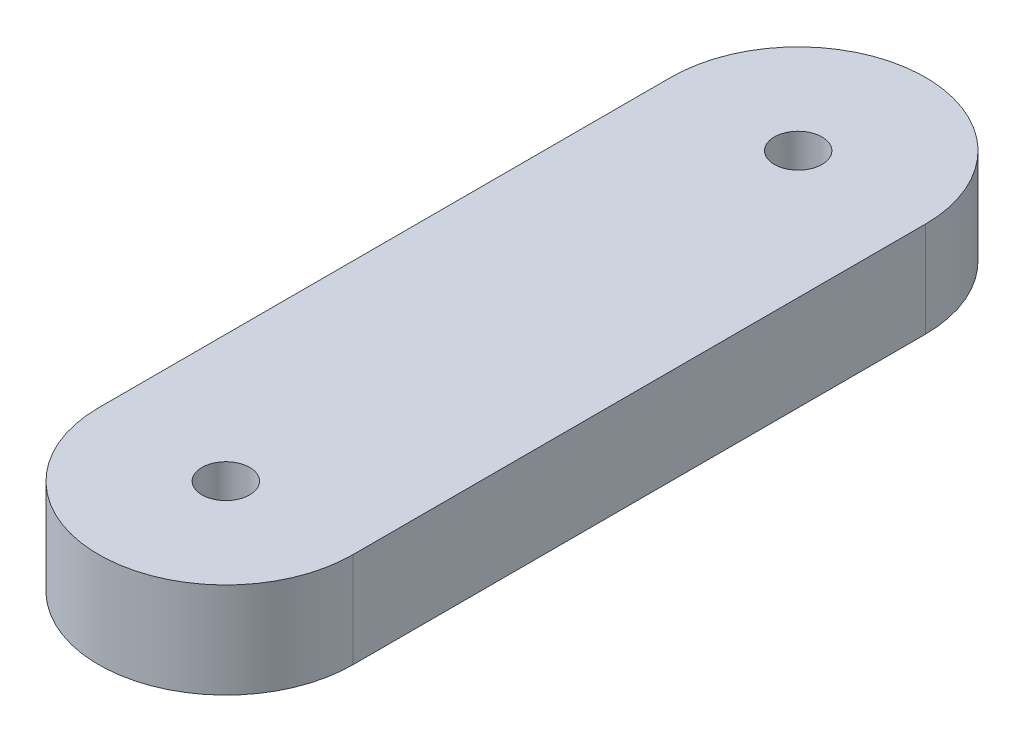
ISO-10303-21;
HEADER;
FILE_DESCRIPTION(('STEP AP214'),'2;1');
FILE_NAME('part.step','',(''),(''),'','','');
FILE_SCHEMA(('AUTOMOTIVE_DESIGN { 1 0 10303 214 1 1 1 1 }'));
ENDSEC;
DATA;
#1=APPLICATION_CONTEXT('core data for automotive mechanical design processes');
#2=APPLICATION_PROTOCOL_DEFINITION('international standard','automotive_design',2000,#1);
#3=PRODUCT_CONTEXT('',#1,'mechanical');
#4=PRODUCT('Part','Part','',(#3));
#5=PRODUCT_RELATED_PRODUCT_CATEGORY('part','',(#4));
#6=PRODUCT_DEFINITION_FORMATION('','',#4);
#7=PRODUCT_DEFINITION_CONTEXT('part definition',#1,'design');
#8=PRODUCT_DEFINITION('design','',#6,#7);
#9=PRODUCT_DEFINITION_SHAPE('','',#8);
#10=(LENGTH_UNIT() NAMED_UNIT(*) SI_UNIT(.MILLI.,.METRE.));
#11=(NAMED_UNIT(*) PLANE_ANGLE_UNIT() SI_UNIT($,.RADIAN.));
#12=(NAMED_UNIT(*) SI_UNIT($,.STERADIAN.) SOLID_ANGLE_UNIT());
#13=UNCERTAINTY_MEASURE_WITH_UNIT(LENGTH_MEASURE(1.E-05),#10,'distance_accuracy_value','');
#14=(GEOMETRIC_REPRESENTATION_CONTEXT(3) GLOBAL_UNCERTAINTY_ASSIGNED_CONTEXT((#13)) GLOBAL_UNIT_ASSIGNED_CONTEXT((#10,
#11,#12)) REPRESENTATION_CONTEXT('',''));
#15=CARTESIAN_POINT('',(0.,0.,0.));
#16=DIRECTION('',(0.,0.,1.));
#17=DIRECTION('',(1.,0.,0.));
#18=AXIS2_PLACEMENT_3D('',#15,#16,#17);
#19=CARTESIAN_POINT('',(0.,6.,-18.));
#20=DIRECTION('',(0.,-1.,0.));
#21=DIRECTION('',(0.,0.,-1.));
#22=AXIS2_PLACEMENT_3D('',#19,#20,#21);
#23=CYLINDRICAL_SURFACE('',#22,8.);
#24=CARTESIAN_POINT('',(0.,0.,-18.));
#25=DIRECTION('',(0.,-1.,0.));
#26=DIRECTION('',(0.,0.,-1.));
#27=AXIS2_PLACEMENT_3D('',#24,#25,#26);
#28=CIRCLE('',#27,8.);
#29=CARTESIAN_POINT('',(-8.,0.,-18.));
#30=VERTEX_POINT('',#29);
#31=CARTESIAN_POINT('',(8.,0.,-18.));
#32=VERTEX_POINT('',#31);
#33=EDGE_CURVE('E99',#30,#32,#28,.T.);
#34=ORIENTED_EDGE('',*,*,#33,.F.);
#35=DIRECTION('',(0.,-1.,0.));
#36=VECTOR('',#35,1.);
#37=CARTESIAN_POINT('',(-8.,6.,-18.));
#38=LINE('',#37,#36);
#39=CARTESIAN_POINT('',(-8.,6.,-18.));
#40=VERTEX_POINT('',#39);
#41=EDGE_CURVE('E11',#40,#30,#38,.T.);
#42=ORIENTED_EDGE('',*,*,#41,.F.);
#43=CARTESIAN_POINT('',(0.,6.,-18.));
#44=DIRECTION('',(0.,-1.,0.));
#45=DIRECTION('',(0.,0.,-1.));
#46=AXIS2_PLACEMENT_3D('',#43,#44,#45);
#47=CIRCLE('',#46,8.);
#48=CARTESIAN_POINT('',(8.,6.,-18.));
#49=VERTEX_POINT('',#48);
#50=EDGE_CURVE('E92',#40,#49,#47,.T.);
#51=ORIENTED_EDGE('',*,*,#50,.T.);
#52=DIRECTION('',(0.,-1.,0.));
#53=VECTOR('',#52,1.);
#54=CARTESIAN_POINT('',(8.,6.,-18.));
#55=LINE('',#54,#53);
#56=EDGE_CURVE('E37',#49,#32,#55,.T.);
#57=ORIENTED_EDGE('',*,*,#56,.T.);
#58=EDGE_LOOP('',(#34,#42,#51,#57));
#59=FACE_BOUND('',#58,.T.);
#60=ADVANCED_FACE('F34',(#59),#23,.T.);
#61=CARTESIAN_POINT('',(-8.,6.,18.));
#62=DIRECTION('',(-1.,0.,0.));
#63=DIRECTION('',(0.,0.,1.));
#64=AXIS2_PLACEMENT_3D('',#61,#62,#63);
#65=PLANE('',#64);
#66=DIRECTION('',(0.,0.,-1.));
#67=VECTOR('',#66,1.);
#68=CARTESIAN_POINT('',(-8.,0.,18.));
#69=LINE('',#68,#67);
#70=CARTESIAN_POINT('',(-8.,0.,18.));
#71=VERTEX_POINT('',#70);
#72=EDGE_CURVE('E94',#71,#30,#69,.T.);
#73=ORIENTED_EDGE('',*,*,#72,.F.);
#74=DIRECTION('',(0.,-1.,0.));
#75=VECTOR('',#74,1.);
#76=CARTESIAN_POINT('',(-8.,6.,18.));
#77=LINE('',#76,#75);
#78=CARTESIAN_POINT('',(-8.,6.,18.));
#79=VERTEX_POINT('',#78);
#80=EDGE_CURVE('E43',#79,#71,#77,.T.);
#81=ORIENTED_EDGE('',*,*,#80,.F.);
#82=DIRECTION('',(0.,0.,-1.));
#83=VECTOR('',#82,1.);
#84=CARTESIAN_POINT('',(-8.,6.,18.));
#85=LINE('',#84,#83);
#86=EDGE_CURVE('E89',#79,#40,#85,.T.);
#87=ORIENTED_EDGE('',*,*,#86,.T.);
#88=ORIENTED_EDGE('',*,*,#41,.T.);
#89=EDGE_LOOP('',(#73,#81,#87,#88));
#90=FACE_BOUND('',#89,.T.);
#91=ADVANCED_FACE('F110',(#90),#65,.T.);
#92=CARTESIAN_POINT('',(0.,6.,18.));
#93=DIRECTION('',(0.,-1.,0.));
#94=DIRECTION('',(0.,0.,-1.));
#95=AXIS2_PLACEMENT_3D('',#92,#93,#94);
#96=CYLINDRICAL_SURFACE('',#95,8.);
#97=CARTESIAN_POINT('',(0.,0.,18.));
#98=DIRECTION('',(0.,-1.,0.));
#99=DIRECTION('',(0.,0.,-1.));
#100=AXIS2_PLACEMENT_3D('',#97,#98,#99);
#101=CIRCLE('',#100,8.);
#102=CARTESIAN_POINT('',(8.,0.,18.));
#103=VERTEX_POINT('',#102);
#104=EDGE_CURVE('E84',#103,#71,#101,.T.);
#105=ORIENTED_EDGE('',*,*,#104,.F.);
#106=DIRECTION('',(0.,-1.,0.));
#107=VECTOR('',#106,1.);
#108=CARTESIAN_POINT('',(8.,6.,18.));
#109=LINE('',#108,#107);
#110=CARTESIAN_POINT('',(8.,6.,18.));
#111=VERTEX_POINT('',#110);
#112=EDGE_CURVE('E79',#111,#103,#109,.T.);
#113=ORIENTED_EDGE('',*,*,#112,.F.);
#114=CARTESIAN_POINT('',(0.,6.,18.));
#115=DIRECTION('',(0.,-1.,0.));
#116=DIRECTION('',(0.,0.,-1.));
#117=AXIS2_PLACEMENT_3D('',#114,#115,#116);
#118=CIRCLE('',#117,8.);
#119=EDGE_CURVE('E82',#111,#79,#118,.T.);
#120=ORIENTED_EDGE('',*,*,#119,.T.);
#121=ORIENTED_EDGE('',*,*,#80,.T.);
#122=EDGE_LOOP('',(#105,#113,#120,#121));
#123=FACE_BOUND('',#122,.T.);
#124=ADVANCED_FACE('F81',(#123),#96,.T.);
#125=CARTESIAN_POINT('',(8.,6.,-18.));
#126=DIRECTION('',(1.,0.,0.));
#127=DIRECTION('',(0.,0.,-1.));
#128=AXIS2_PLACEMENT_3D('',#125,#126,#127);
#129=PLANE('',#128);
#130=DIRECTION('',(0.,0.,1.));
#131=VECTOR('',#130,1.);
#132=CARTESIAN_POINT('',(8.,0.,-18.));
#133=LINE('',#132,#131);
#134=EDGE_CURVE('E102',#32,#103,#133,.T.);
#135=ORIENTED_EDGE('',*,*,#134,.F.);
#136=ORIENTED_EDGE('',*,*,#56,.F.);
#137=DIRECTION('',(0.,0.,1.));
#138=VECTOR('',#137,1.);
#139=CARTESIAN_POINT('',(8.,6.,-18.));
#140=LINE('',#139,#138);
#141=EDGE_CURVE('E88',#49,#111,#140,.T.);
#142=ORIENTED_EDGE('',*,*,#141,.T.);
#143=ORIENTED_EDGE('',*,*,#112,.T.);
#144=EDGE_LOOP('',(#135,#136,#142,#143));
#145=FACE_BOUND('',#144,.T.);
#146=ADVANCED_FACE('F91',(#145),#129,.T.);
#147=CARTESIAN_POINT('',(0.,6.,-18.));
#148=DIRECTION('',(0.,-1.,0.));
#149=DIRECTION('',(0.,0.,-1.));
#150=AXIS2_PLACEMENT_3D('',#147,#148,#149);
#151=PLANE('',#150);
#152=CARTESIAN_POINT('',(0.,6.,18.));
#153=DIRECTION('',(0.,-1.,0.));
#154=DIRECTION('',(0.,0.,1.));
#155=AXIS2_PLACEMENT_3D('',#152,#153,#154);
#156=CIRCLE('',#155,1.5);
#157=CARTESIAN_POINT('',(0.,6.,19.5));
#158=VERTEX_POINT('',#157);
#159=EDGE_CURVE('E143',#158,#158,#156,.T.);
#160=ORIENTED_EDGE('',*,*,#159,.T.);
#161=EDGE_LOOP('',(#160));
#162=FACE_BOUND('',#161,.T.);
#163=CARTESIAN_POINT('',(0.,6.,-18.));
#164=DIRECTION('',(0.,-1.,0.));
#165=DIRECTION('',(0.,0.,1.));
#166=AXIS2_PLACEMENT_3D('',#163,#164,#165);
#167=CIRCLE('',#166,1.5);
#168=CARTESIAN_POINT('',(0.,6.,-16.5));
#169=VERTEX_POINT('',#168);
#170=EDGE_CURVE('E103',#169,#169,#167,.T.);
#171=ORIENTED_EDGE('',*,*,#170,.T.);
#172=EDGE_LOOP('',(#171));
#173=FACE_BOUND('',#172,.T.);
#174=ORIENTED_EDGE('',*,*,#50,.F.);
#175=ORIENTED_EDGE('',*,*,#86,.F.);
#176=ORIENTED_EDGE('',*,*,#119,.F.);
#177=ORIENTED_EDGE('',*,*,#141,.F.);
#178=EDGE_LOOP('',(#174,#175,#176,#177));
#179=FACE_BOUND('',#178,.T.);
#180=ADVANCED_FACE('F87',(#162,#173,#179),#151,.F.);
#181=CARTESIAN_POINT('',(0.,0.,-18.));
#182=DIRECTION('',(0.,-1.,0.));
#183=DIRECTION('',(0.,0.,-1.));
#184=AXIS2_PLACEMENT_3D('',#181,#182,#183);
#185=PLANE('',#184);
#186=CARTESIAN_POINT('',(0.,0.,18.));
#187=DIRECTION('',(0.,-1.,0.));
#188=DIRECTION('',(0.,0.,1.));
#189=AXIS2_PLACEMENT_3D('',#186,#187,#188);
#190=CIRCLE('',#189,1.5);
#191=CARTESIAN_POINT('',(0.,0.,19.5));
#192=VERTEX_POINT('',#191);
#193=EDGE_CURVE('E146',#192,#192,#190,.T.);
#194=ORIENTED_EDGE('',*,*,#193,.F.);
#195=EDGE_LOOP('',(#194));
#196=FACE_BOUND('',#195,.T.);
#197=CARTESIAN_POINT('',(0.,0.,-18.));
#198=DIRECTION('',(0.,-1.,0.));
#199=DIRECTION('',(0.,0.,1.));
#200=AXIS2_PLACEMENT_3D('',#197,#198,#199);
#201=CIRCLE('',#200,1.5);
#202=CARTESIAN_POINT('',(0.,0.,-16.5));
#203=VERTEX_POINT('',#202);
#204=EDGE_CURVE('E148',#203,#203,#201,.T.);
#205=ORIENTED_EDGE('',*,*,#204,.F.);
#206=EDGE_LOOP('',(#205));
#207=FACE_BOUND('',#206,.T.);
#208=ORIENTED_EDGE('',*,*,#33,.T.);
#209=ORIENTED_EDGE('',*,*,#134,.T.);
#210=ORIENTED_EDGE('',*,*,#104,.T.);
#211=ORIENTED_EDGE('',*,*,#72,.T.);
#212=EDGE_LOOP('',(#208,#209,#210,#211));
#213=FACE_BOUND('',#212,.T.);
#214=ADVANCED_FACE('F109',(#196,#207,#213),#185,.T.);
#215=CARTESIAN_POINT('',(0.,6.,-18.));
#216=DIRECTION('',(0.,-1.,0.));
#217=DIRECTION('',(0.,0.,-1.));
#218=AXIS2_PLACEMENT_3D('',#215,#216,#217);
#219=CYLINDRICAL_SURFACE('',#218,1.5);
#220=ORIENTED_EDGE('',*,*,#170,.F.);
#221=EDGE_LOOP('',(#220));
#222=FACE_BOUND('',#221,.T.);
#223=ORIENTED_EDGE('',*,*,#204,.T.);
#224=EDGE_LOOP('',(#223));
#225=FACE_BOUND('',#224,.T.);
#226=ADVANCED_FACE('F128',(#222,#225),#219,.F.);
#227=CARTESIAN_POINT('',(0.,6.,18.));
#228=DIRECTION('',(0.,-1.,0.));
#229=DIRECTION('',(0.,0.,-1.));
#230=AXIS2_PLACEMENT_3D('',#227,#228,#229);
#231=CYLINDRICAL_SURFACE('',#230,1.5);
#232=ORIENTED_EDGE('',*,*,#159,.F.);
#233=EDGE_LOOP('',(#232));
#234=FACE_BOUND('',#233,.T.);
#235=ORIENTED_EDGE('',*,*,#193,.T.);
#236=EDGE_LOOP('',(#235));
#237=FACE_BOUND('',#236,.T.);
#238=ADVANCED_FACE('F135',(#234,#237),#231,.F.);
#239=CLOSED_SHELL('',(#60,#91,#124,#146,#180,#214,#226,#238));
#240=MANIFOLD_SOLID_BREP('B2',#239);
#241=ADVANCED_BREP_SHAPE_REPRESENTATION('',(#18,#240),#14);
#242=SHAPE_DEFINITION_REPRESENTATION(#9,#241);
ENDSEC;
END-ISO-10303-21;
